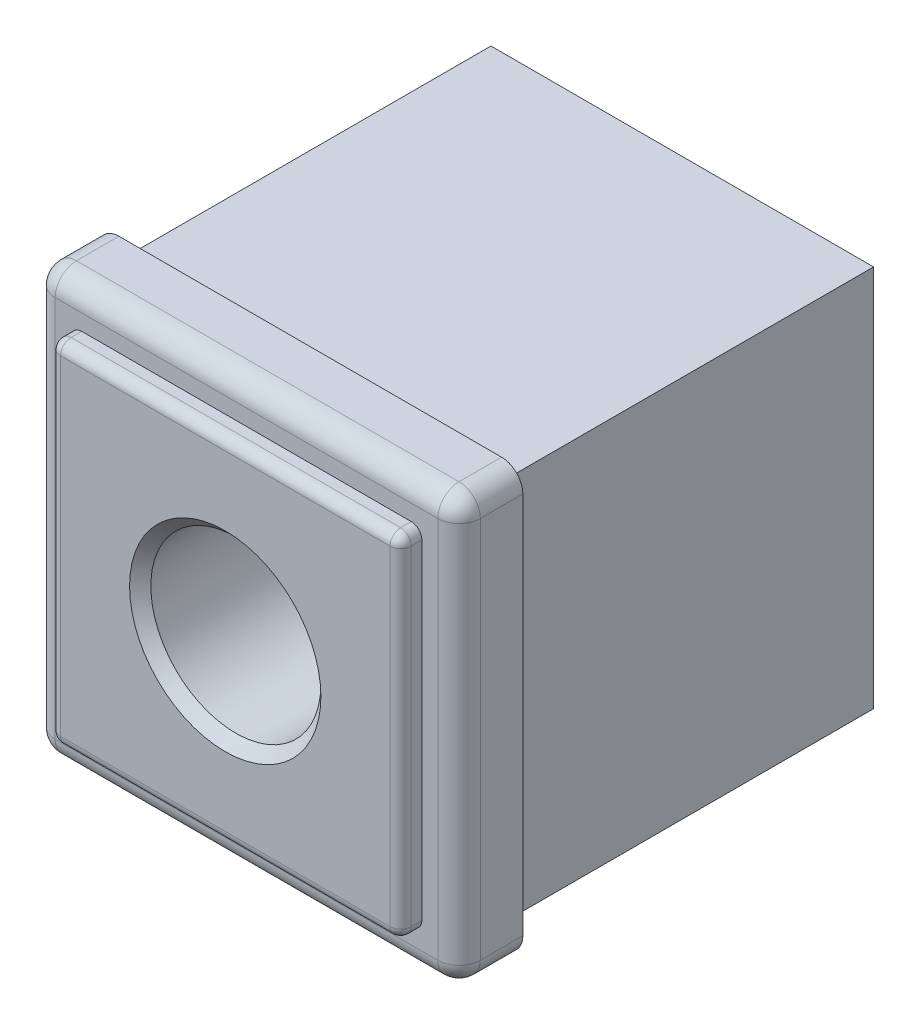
ISO-10303-21;
HEADER;
FILE_DESCRIPTION(('STEP AP214'),'2;1');
FILE_NAME('part.step','',(''),(''),'','','');
FILE_SCHEMA(('AUTOMOTIVE_DESIGN { 1 0 10303 214 1 1 1 1 }'));
ENDSEC;
DATA;
#1=APPLICATION_CONTEXT('core data for automotive mechanical design processes');
#2=APPLICATION_PROTOCOL_DEFINITION('international standard','automotive_design',2000,#1);
#3=PRODUCT_CONTEXT('',#1,'mechanical');
#4=PRODUCT('Part','Part','',(#3));
#5=PRODUCT_RELATED_PRODUCT_CATEGORY('part','',(#4));
#6=PRODUCT_DEFINITION_FORMATION('','',#4);
#7=PRODUCT_DEFINITION_CONTEXT('part definition',#1,'design');
#8=PRODUCT_DEFINITION('design','',#6,#7);
#9=PRODUCT_DEFINITION_SHAPE('','',#8);
#10=(LENGTH_UNIT() NAMED_UNIT(*) SI_UNIT(.MILLI.,.METRE.));
#11=(NAMED_UNIT(*) PLANE_ANGLE_UNIT() SI_UNIT($,.RADIAN.));
#12=(NAMED_UNIT(*) SI_UNIT($,.STERADIAN.) SOLID_ANGLE_UNIT());
#13=UNCERTAINTY_MEASURE_WITH_UNIT(LENGTH_MEASURE(1.E-05),#10,'distance_accuracy_value','');
#14=(GEOMETRIC_REPRESENTATION_CONTEXT(3) GLOBAL_UNCERTAINTY_ASSIGNED_CONTEXT((#13)) GLOBAL_UNIT_ASSIGNED_CONTEXT((#10,
#11,#12)) REPRESENTATION_CONTEXT('',''));
#15=CARTESIAN_POINT('',(0.,0.,0.));
#16=DIRECTION('',(0.,0.,1.));
#17=DIRECTION('',(1.,0.,0.));
#18=AXIS2_PLACEMENT_3D('',#15,#16,#17);
#19=CARTESIAN_POINT('',(20.,-20.,6.));
#20=DIRECTION('',(0.,0.,1.));
#21=DIRECTION('',(1.,0.,0.));
#22=AXIS2_PLACEMENT_3D('',#19,#20,#21);
#23=PLANE('',#22);
#24=DIRECTION('',(0.,1.,0.));
#25=VECTOR('',#24,1.);
#26=CARTESIAN_POINT('',(18.,18.,6.));
#27=LINE('',#26,#25);
#28=CARTESIAN_POINT('',(18.,-18.,6.));
#29=VERTEX_POINT('',#28);
#30=CARTESIAN_POINT('',(18.,18.,6.));
#31=VERTEX_POINT('',#30);
#32=EDGE_CURVE('E344',#29,#31,#27,.T.);
#33=ORIENTED_EDGE('',*,*,#32,.T.);
#34=DIRECTION('',(-1.,0.,0.));
#35=VECTOR('',#34,1.);
#36=CARTESIAN_POINT('',(-18.,18.,6.));
#37=LINE('',#36,#35);
#38=CARTESIAN_POINT('',(-18.,18.,6.));
#39=VERTEX_POINT('',#38);
#40=EDGE_CURVE('E348',#31,#39,#37,.T.);
#41=ORIENTED_EDGE('',*,*,#40,.T.);
#42=DIRECTION('',(0.,-1.,0.));
#43=VECTOR('',#42,1.);
#44=CARTESIAN_POINT('',(-18.,-18.,6.));
#45=LINE('',#44,#43);
#46=CARTESIAN_POINT('',(-18.,-18.,6.));
#47=VERTEX_POINT('',#46);
#48=EDGE_CURVE('E346',#39,#47,#45,.T.);
#49=ORIENTED_EDGE('',*,*,#48,.T.);
#50=DIRECTION('',(1.,0.,0.));
#51=VECTOR('',#50,1.);
#52=CARTESIAN_POINT('',(18.,-18.,6.));
#53=LINE('',#52,#51);
#54=EDGE_CURVE('E342',#47,#29,#53,.T.);
#55=ORIENTED_EDGE('',*,*,#54,.T.);
#56=EDGE_LOOP('',(#33,#41,#49,#55));
#57=FACE_BOUND('',#56,.T.);
#58=DIRECTION('',(1.,0.,0.));
#59=VECTOR('',#58,1.);
#60=CARTESIAN_POINT('',(-16.5,-16.5,6.));
#61=LINE('',#60,#59);
#62=CARTESIAN_POINT('',(-15.5,-16.5,6.));
#63=VERTEX_POINT('',#62);
#64=CARTESIAN_POINT('',(15.5,-16.5,6.));
#65=VERTEX_POINT('',#64);
#66=EDGE_CURVE('E266',#63,#65,#61,.T.);
#67=ORIENTED_EDGE('',*,*,#66,.F.);
#68=CARTESIAN_POINT('',(-15.5,-15.5,6.));
#69=DIRECTION('',(0.,0.,1.));
#70=DIRECTION('',(1.,0.,0.));
#71=AXIS2_PLACEMENT_3D('',#68,#69,#70);
#72=CIRCLE('',#71,1.);
#73=CARTESIAN_POINT('',(-16.5,-15.5,6.));
#74=VERTEX_POINT('',#73);
#75=EDGE_CURVE('E338',#63,#74,#72,.F.);
#76=ORIENTED_EDGE('',*,*,#75,.T.);
#77=DIRECTION('',(0.,-1.,0.));
#78=VECTOR('',#77,1.);
#79=CARTESIAN_POINT('',(-16.5,16.5,6.));
#80=LINE('',#79,#78);
#81=CARTESIAN_POINT('',(-16.5,15.5,6.));
#82=VERTEX_POINT('',#81);
#83=EDGE_CURVE('E263',#82,#74,#80,.T.);
#84=ORIENTED_EDGE('',*,*,#83,.F.);
#85=CARTESIAN_POINT('',(-15.5,15.5,6.));
#86=DIRECTION('',(0.,0.,1.));
#87=DIRECTION('',(1.,0.,0.));
#88=AXIS2_PLACEMENT_3D('',#85,#86,#87);
#89=CIRCLE('',#88,1.);
#90=CARTESIAN_POINT('',(-15.5,16.5,6.));
#91=VERTEX_POINT('',#90);
#92=EDGE_CURVE('E334',#82,#91,#89,.F.);
#93=ORIENTED_EDGE('',*,*,#92,.T.);
#94=DIRECTION('',(-1.,0.,0.));
#95=VECTOR('',#94,1.);
#96=CARTESIAN_POINT('',(-16.5,16.5,6.));
#97=LINE('',#96,#95);
#98=CARTESIAN_POINT('',(15.5,16.5,6.));
#99=VERTEX_POINT('',#98);
#100=EDGE_CURVE('E272',#99,#91,#97,.T.);
#101=ORIENTED_EDGE('',*,*,#100,.F.);
#102=CARTESIAN_POINT('',(15.5,15.5,6.));
#103=DIRECTION('',(0.,0.,1.));
#104=DIRECTION('',(1.,0.,0.));
#105=AXIS2_PLACEMENT_3D('',#102,#103,#104);
#106=CIRCLE('',#105,1.);
#107=CARTESIAN_POINT('',(16.5,15.5,6.));
#108=VERTEX_POINT('',#107);
#109=EDGE_CURVE('E336',#99,#108,#106,.F.);
#110=ORIENTED_EDGE('',*,*,#109,.T.);
#111=DIRECTION('',(0.,1.,0.));
#112=VECTOR('',#111,1.);
#113=CARTESIAN_POINT('',(16.5,16.5,6.));
#114=LINE('',#113,#112);
#115=CARTESIAN_POINT('',(16.5,-15.5,6.));
#116=VERTEX_POINT('',#115);
#117=EDGE_CURVE('E269',#116,#108,#114,.T.);
#118=ORIENTED_EDGE('',*,*,#117,.F.);
#119=CARTESIAN_POINT('',(15.5,-15.5,6.));
#120=DIRECTION('',(0.,0.,1.));
#121=DIRECTION('',(1.,0.,0.));
#122=AXIS2_PLACEMENT_3D('',#119,#120,#121);
#123=CIRCLE('',#122,1.);
#124=EDGE_CURVE('E340',#116,#65,#123,.F.);
#125=ORIENTED_EDGE('',*,*,#124,.T.);
#126=EDGE_LOOP('',(#67,#76,#84,#93,#101,#110,#118,#125));
#127=FACE_BOUND('',#126,.T.);
#128=ADVANCED_FACE('F14',(#57,#127),#23,.T.);
#129=CARTESIAN_POINT('',(-18.25,-18.25,-35.));
#130=DIRECTION('',(0.,0.,1.));
#131=DIRECTION('',(1.,0.,0.));
#132=AXIS2_PLACEMENT_3D('',#129,#130,#131);
#133=PLANE('',#132);
#134=DIRECTION('',(0.,1.,0.));
#135=VECTOR('',#134,1.);
#136=CARTESIAN_POINT('',(-18.,-18.,-35.));
#137=LINE('',#136,#135);
#138=CARTESIAN_POINT('',(-18.,-18.,-35.));
#139=VERTEX_POINT('',#138);
#140=CARTESIAN_POINT('',(-18.,18.,-35.));
#141=VERTEX_POINT('',#140);
#142=EDGE_CURVE('E198',#139,#141,#137,.T.);
#143=ORIENTED_EDGE('',*,*,#142,.T.);
#144=DIRECTION('',(1.,0.,0.));
#145=VECTOR('',#144,1.);
#146=CARTESIAN_POINT('',(-18.,18.,-35.));
#147=LINE('',#146,#145);
#148=CARTESIAN_POINT('',(18.,18.,-35.));
#149=VERTEX_POINT('',#148);
#150=EDGE_CURVE('E29',#141,#149,#147,.T.);
#151=ORIENTED_EDGE('',*,*,#150,.T.);
#152=DIRECTION('',(0.,-1.,0.));
#153=VECTOR('',#152,1.);
#154=CARTESIAN_POINT('',(18.,18.,-35.));
#155=LINE('',#154,#153);
#156=CARTESIAN_POINT('',(18.,-18.,-35.));
#157=VERTEX_POINT('',#156);
#158=EDGE_CURVE('E187',#149,#157,#155,.T.);
#159=ORIENTED_EDGE('',*,*,#158,.T.);
#160=DIRECTION('',(-1.,0.,0.));
#161=VECTOR('',#160,1.);
#162=CARTESIAN_POINT('',(18.,-18.,-35.));
#163=LINE('',#162,#161);
#164=EDGE_CURVE('E192',#157,#139,#163,.T.);
#165=ORIENTED_EDGE('',*,*,#164,.T.);
#166=EDGE_LOOP('',(#143,#151,#159,#165));
#167=FACE_BOUND('',#166,.T.);
#168=CARTESIAN_POINT('',(0.,0.,-35.));
#169=DIRECTION('',(0.,0.,1.));
#170=DIRECTION('',(1.,0.,0.));
#171=AXIS2_PLACEMENT_3D('',#168,#169,#170);
#172=CIRCLE('',#171,8.);
#173=CARTESIAN_POINT('',(8.,0.,-35.));
#174=VERTEX_POINT('',#173);
#175=EDGE_CURVE('E183',#174,#174,#172,.T.);
#176=ORIENTED_EDGE('',*,*,#175,.T.);
#177=EDGE_LOOP('',(#176));
#178=FACE_BOUND('',#177,.T.);
#179=ADVANCED_FACE('F195',(#167,#178),#133,.F.);
#180=CARTESIAN_POINT('',(20.,-20.,0.));
#181=DIRECTION('',(0.,0.,1.));
#182=DIRECTION('',(1.,0.,0.));
#183=AXIS2_PLACEMENT_3D('',#180,#181,#182);
#184=PLANE('',#183);
#185=DIRECTION('',(-1.,0.,0.));
#186=VECTOR('',#185,1.);
#187=CARTESIAN_POINT('',(-20.,20.,0.));
#188=LINE('',#187,#186);
#189=CARTESIAN_POINT('',(18.,20.,0.));
#190=VERTEX_POINT('',#189);
#191=CARTESIAN_POINT('',(-18.,20.,0.));
#192=VERTEX_POINT('',#191);
#193=EDGE_CURVE('E278',#190,#192,#188,.T.);
#194=ORIENTED_EDGE('',*,*,#193,.F.);
#195=CARTESIAN_POINT('',(18.,18.,0.));
#196=DIRECTION('',(0.,0.,1.));
#197=DIRECTION('',(1.,0.,0.));
#198=AXIS2_PLACEMENT_3D('',#195,#196,#197);
#199=CIRCLE('',#198,2.);
#200=CARTESIAN_POINT('',(20.,18.,0.));
#201=VERTEX_POINT('',#200);
#202=EDGE_CURVE('E298',#190,#201,#199,.F.);
#203=ORIENTED_EDGE('',*,*,#202,.T.);
#204=DIRECTION('',(0.,1.,0.));
#205=VECTOR('',#204,1.);
#206=CARTESIAN_POINT('',(20.,20.,0.));
#207=LINE('',#206,#205);
#208=CARTESIAN_POINT('',(20.,-18.,0.));
#209=VERTEX_POINT('',#208);
#210=EDGE_CURVE('E275',#209,#201,#207,.T.);
#211=ORIENTED_EDGE('',*,*,#210,.F.);
#212=CARTESIAN_POINT('',(18.,-18.,0.));
#213=DIRECTION('',(0.,0.,1.));
#214=DIRECTION('',(1.,0.,0.));
#215=AXIS2_PLACEMENT_3D('',#212,#213,#214);
#216=CIRCLE('',#215,2.);
#217=CARTESIAN_POINT('',(18.,-20.,0.));
#218=VERTEX_POINT('',#217);
#219=EDGE_CURVE('E294',#209,#218,#216,.F.);
#220=ORIENTED_EDGE('',*,*,#219,.T.);
#221=DIRECTION('',(1.,0.,0.));
#222=VECTOR('',#221,1.);
#223=CARTESIAN_POINT('',(-20.,-20.,0.));
#224=LINE('',#223,#222);
#225=CARTESIAN_POINT('',(-18.,-20.,0.));
#226=VERTEX_POINT('',#225);
#227=EDGE_CURVE('E284',#226,#218,#224,.T.);
#228=ORIENTED_EDGE('',*,*,#227,.F.);
#229=CARTESIAN_POINT('',(-18.,-18.,0.));
#230=DIRECTION('',(0.,0.,1.));
#231=DIRECTION('',(1.,0.,0.));
#232=AXIS2_PLACEMENT_3D('',#229,#230,#231);
#233=CIRCLE('',#232,2.);
#234=CARTESIAN_POINT('',(-20.,-18.,0.));
#235=VERTEX_POINT('',#234);
#236=EDGE_CURVE('E292',#226,#235,#233,.F.);
#237=ORIENTED_EDGE('',*,*,#236,.T.);
#238=DIRECTION('',(0.,-1.,0.));
#239=VECTOR('',#238,1.);
#240=CARTESIAN_POINT('',(-20.,20.,0.));
#241=LINE('',#240,#239);
#242=CARTESIAN_POINT('',(-20.,18.,0.));
#243=VERTEX_POINT('',#242);
#244=EDGE_CURVE('E281',#243,#235,#241,.T.);
#245=ORIENTED_EDGE('',*,*,#244,.F.);
#246=CARTESIAN_POINT('',(-18.,18.,0.));
#247=DIRECTION('',(0.,0.,1.));
#248=DIRECTION('',(1.,0.,0.));
#249=AXIS2_PLACEMENT_3D('',#246,#247,#248);
#250=CIRCLE('',#249,2.);
#251=EDGE_CURVE('E296',#243,#192,#250,.F.);
#252=ORIENTED_EDGE('',*,*,#251,.T.);
#253=EDGE_LOOP('',(#194,#203,#211,#220,#228,#237,#245,#252));
#254=FACE_BOUND('',#253,.T.);
#255=DIRECTION('',(1.,0.,0.));
#256=VECTOR('',#255,1.);
#257=CARTESIAN_POINT('',(-18.,18.,0.));
#258=LINE('',#257,#256);
#259=CARTESIAN_POINT('',(-18.,18.,0.));
#260=VERTEX_POINT('',#259);
#261=CARTESIAN_POINT('',(18.,18.,0.));
#262=VERTEX_POINT('',#261);
#263=EDGE_CURVE('E180',#260,#262,#258,.T.);
#264=ORIENTED_EDGE('',*,*,#263,.F.);
#265=DIRECTION('',(0.,1.,0.));
#266=VECTOR('',#265,1.);
#267=CARTESIAN_POINT('',(-18.,-18.,0.));
#268=LINE('',#267,#266);
#269=CARTESIAN_POINT('',(-18.,-18.,0.));
#270=VERTEX_POINT('',#269);
#271=EDGE_CURVE('E199',#270,#260,#268,.T.);
#272=ORIENTED_EDGE('',*,*,#271,.F.);
#273=DIRECTION('',(-1.,0.,0.));
#274=VECTOR('',#273,1.);
#275=CARTESIAN_POINT('',(18.,-18.,0.));
#276=LINE('',#275,#274);
#277=CARTESIAN_POINT('',(18.,-18.,0.));
#278=VERTEX_POINT('',#277);
#279=EDGE_CURVE('E202',#278,#270,#276,.T.);
#280=ORIENTED_EDGE('',*,*,#279,.F.);
#281=DIRECTION('',(0.,-1.,0.));
#282=VECTOR('',#281,1.);
#283=CARTESIAN_POINT('',(18.,18.,0.));
#284=LINE('',#283,#282);
#285=EDGE_CURVE('E209',#262,#278,#284,.T.);
#286=ORIENTED_EDGE('',*,*,#285,.F.);
#287=EDGE_LOOP('',(#264,#272,#280,#286));
#288=FACE_BOUND('',#287,.T.);
#289=ADVANCED_FACE('F417',(#254,#288),#184,.F.);
#290=CARTESIAN_POINT('',(20.,20.,6.));
#291=DIRECTION('',(-1.,0.,0.));
#292=DIRECTION('',(0.,-1.,0.));
#293=AXIS2_PLACEMENT_3D('',#290,#291,#292);
#294=PLANE('',#293);
#295=DIRECTION('',(0.,0.,-1.));
#296=VECTOR('',#295,1.);
#297=CARTESIAN_POINT('',(20.,18.,6.));
#298=LINE('',#297,#296);
#299=CARTESIAN_POINT('',(20.,18.,4.));
#300=VERTEX_POINT('',#299);
#301=EDGE_CURVE('E302',#201,#300,#298,.F.);
#302=ORIENTED_EDGE('',*,*,#301,.T.);
#303=DIRECTION('',(0.,1.,0.));
#304=VECTOR('',#303,1.);
#305=CARTESIAN_POINT('',(20.,-18.,4.));
#306=LINE('',#305,#304);
#307=CARTESIAN_POINT('',(20.,-18.,4.));
#308=VERTEX_POINT('',#307);
#309=EDGE_CURVE('E360',#300,#308,#306,.F.);
#310=ORIENTED_EDGE('',*,*,#309,.T.);
#311=DIRECTION('',(0.,0.,-1.));
#312=VECTOR('',#311,1.);
#313=CARTESIAN_POINT('',(20.,-18.,6.));
#314=LINE('',#313,#312);
#315=EDGE_CURVE('E300',#308,#209,#314,.T.);
#316=ORIENTED_EDGE('',*,*,#315,.T.);
#317=ORIENTED_EDGE('',*,*,#210,.T.);
#318=EDGE_LOOP('',(#302,#310,#316,#317));
#319=FACE_BOUND('',#318,.T.);
#320=ADVANCED_FACE('F434',(#319),#294,.F.);
#321=CARTESIAN_POINT('',(-20.,20.,6.));
#322=DIRECTION('',(0.,-1.,0.));
#323=DIRECTION('',(0.,0.,-1.));
#324=AXIS2_PLACEMENT_3D('',#321,#322,#323);
#325=PLANE('',#324);
#326=DIRECTION('',(0.,0.,-1.));
#327=VECTOR('',#326,1.);
#328=CARTESIAN_POINT('',(-18.,20.,6.));
#329=LINE('',#328,#327);
#330=CARTESIAN_POINT('',(-18.,20.,4.));
#331=VERTEX_POINT('',#330);
#332=EDGE_CURVE('E287',#192,#331,#329,.F.);
#333=ORIENTED_EDGE('',*,*,#332,.T.);
#334=DIRECTION('',(-1.,0.,0.));
#335=VECTOR('',#334,1.);
#336=CARTESIAN_POINT('',(18.,20.,4.));
#337=LINE('',#336,#335);
#338=CARTESIAN_POINT('',(18.,20.,4.));
#339=VERTEX_POINT('',#338);
#340=EDGE_CURVE('E351',#331,#339,#337,.F.);
#341=ORIENTED_EDGE('',*,*,#340,.T.);
#342=DIRECTION('',(0.,0.,-1.));
#343=VECTOR('',#342,1.);
#344=CARTESIAN_POINT('',(18.,20.,6.));
#345=LINE('',#344,#343);
#346=EDGE_CURVE('E290',#339,#190,#345,.T.);
#347=ORIENTED_EDGE('',*,*,#346,.T.);
#348=ORIENTED_EDGE('',*,*,#193,.T.);
#349=EDGE_LOOP('',(#333,#341,#347,#348));
#350=FACE_BOUND('',#349,.T.);
#351=ADVANCED_FACE('F430',(#350),#325,.F.);
#352=CARTESIAN_POINT('',(-20.,20.,6.));
#353=DIRECTION('',(1.,0.,0.));
#354=DIRECTION('',(0.,0.,-1.));
#355=AXIS2_PLACEMENT_3D('',#352,#353,#354);
#356=PLANE('',#355);
#357=DIRECTION('',(0.,0.,-1.));
#358=VECTOR('',#357,1.);
#359=CARTESIAN_POINT('',(-20.,-18.,6.));
#360=LINE('',#359,#358);
#361=CARTESIAN_POINT('',(-20.,-18.,4.));
#362=VERTEX_POINT('',#361);
#363=EDGE_CURVE('E305',#235,#362,#360,.F.);
#364=ORIENTED_EDGE('',*,*,#363,.T.);
#365=DIRECTION('',(0.,-1.,0.));
#366=VECTOR('',#365,1.);
#367=CARTESIAN_POINT('',(-20.,18.,4.));
#368=LINE('',#367,#366);
#369=CARTESIAN_POINT('',(-20.,18.,4.));
#370=VERTEX_POINT('',#369);
#371=EDGE_CURVE('E358',#362,#370,#368,.F.);
#372=ORIENTED_EDGE('',*,*,#371,.T.);
#373=DIRECTION('',(0.,0.,-1.));
#374=VECTOR('',#373,1.);
#375=CARTESIAN_POINT('',(-20.,18.,6.));
#376=LINE('',#375,#374);
#377=EDGE_CURVE('E308',#370,#243,#376,.T.);
#378=ORIENTED_EDGE('',*,*,#377,.T.);
#379=ORIENTED_EDGE('',*,*,#244,.T.);
#380=EDGE_LOOP('',(#364,#372,#378,#379));
#381=FACE_BOUND('',#380,.T.);
#382=ADVANCED_FACE('F426',(#381),#356,.F.);
#383=CARTESIAN_POINT('',(-20.,-20.,6.));
#384=DIRECTION('',(0.,1.,0.));
#385=DIRECTION('',(0.,0.,1.));
#386=AXIS2_PLACEMENT_3D('',#383,#384,#385);
#387=PLANE('',#386);
#388=DIRECTION('',(0.,0.,-1.));
#389=VECTOR('',#388,1.);
#390=CARTESIAN_POINT('',(18.,-20.,6.));
#391=LINE('',#390,#389);
#392=CARTESIAN_POINT('',(18.,-20.,4.));
#393=VERTEX_POINT('',#392);
#394=EDGE_CURVE('E312',#218,#393,#391,.F.);
#395=ORIENTED_EDGE('',*,*,#394,.T.);
#396=DIRECTION('',(1.,0.,0.));
#397=VECTOR('',#396,1.);
#398=CARTESIAN_POINT('',(-18.,-20.,4.));
#399=LINE('',#398,#397);
#400=CARTESIAN_POINT('',(-18.,-20.,4.));
#401=VERTEX_POINT('',#400);
#402=EDGE_CURVE('E366',#393,#401,#399,.F.);
#403=ORIENTED_EDGE('',*,*,#402,.T.);
#404=DIRECTION('',(0.,0.,-1.));
#405=VECTOR('',#404,1.);
#406=CARTESIAN_POINT('',(-18.,-20.,6.));
#407=LINE('',#406,#405);
#408=EDGE_CURVE('E310',#401,#226,#407,.T.);
#409=ORIENTED_EDGE('',*,*,#408,.T.);
#410=ORIENTED_EDGE('',*,*,#227,.T.);
#411=EDGE_LOOP('',(#395,#403,#409,#410));
#412=FACE_BOUND('',#411,.T.);
#413=ADVANCED_FACE('F422',(#412),#387,.F.);
#414=CARTESIAN_POINT('',(-16.5,16.5,8.));
#415=DIRECTION('',(1.,0.,0.));
#416=DIRECTION('',(0.,1.,0.));
#417=AXIS2_PLACEMENT_3D('',#414,#415,#416);
#418=PLANE('',#417);
#419=DIRECTION('',(0.,0.,-1.));
#420=VECTOR('',#419,1.);
#421=CARTESIAN_POINT('',(-16.5,-15.5,8.));
#422=LINE('',#421,#420);
#423=CARTESIAN_POINT('',(-16.5,-15.5,7.));
#424=VERTEX_POINT('',#423);
#425=EDGE_CURVE('E315',#74,#424,#422,.F.);
#426=ORIENTED_EDGE('',*,*,#425,.T.);
#427=DIRECTION('',(0.,-1.,0.));
#428=VECTOR('',#427,1.);
#429=CARTESIAN_POINT('',(-16.5,15.5,7.));
#430=LINE('',#429,#428);
#431=CARTESIAN_POINT('',(-16.5,15.5,7.));
#432=VERTEX_POINT('',#431);
#433=EDGE_CURVE('E377',#424,#432,#430,.F.);
#434=ORIENTED_EDGE('',*,*,#433,.T.);
#435=DIRECTION('',(0.,0.,-1.));
#436=VECTOR('',#435,1.);
#437=CARTESIAN_POINT('',(-16.5,15.5,8.));
#438=LINE('',#437,#436);
#439=EDGE_CURVE('E318',#432,#82,#438,.T.);
#440=ORIENTED_EDGE('',*,*,#439,.T.);
#441=ORIENTED_EDGE('',*,*,#83,.T.);
#442=EDGE_LOOP('',(#426,#434,#440,#441));
#443=FACE_BOUND('',#442,.T.);
#444=ADVANCED_FACE('F425',(#443),#418,.F.);
#445=CARTESIAN_POINT('',(-16.5,-16.5,8.));
#446=DIRECTION('',(0.,1.,0.));
#447=DIRECTION('',(-1.,0.,0.));
#448=AXIS2_PLACEMENT_3D('',#445,#446,#447);
#449=PLANE('',#448);
#450=DIRECTION('',(0.,0.,-1.));
#451=VECTOR('',#450,1.);
#452=CARTESIAN_POINT('',(15.5,-16.5,8.));
#453=LINE('',#452,#451);
#454=CARTESIAN_POINT('',(15.5,-16.5,7.));
#455=VERTEX_POINT('',#454);
#456=EDGE_CURVE('E329',#65,#455,#453,.F.);
#457=ORIENTED_EDGE('',*,*,#456,.T.);
#458=DIRECTION('',(1.,0.,0.));
#459=VECTOR('',#458,1.);
#460=CARTESIAN_POINT('',(-15.5,-16.5,7.));
#461=LINE('',#460,#459);
#462=CARTESIAN_POINT('',(-15.5,-16.5,7.));
#463=VERTEX_POINT('',#462);
#464=EDGE_CURVE('E384',#455,#463,#461,.F.);
#465=ORIENTED_EDGE('',*,*,#464,.T.);
#466=DIRECTION('',(0.,0.,-1.));
#467=VECTOR('',#466,1.);
#468=CARTESIAN_POINT('',(-15.5,-16.5,8.));
#469=LINE('',#468,#467);
#470=EDGE_CURVE('E332',#463,#63,#469,.T.);
#471=ORIENTED_EDGE('',*,*,#470,.T.);
#472=ORIENTED_EDGE('',*,*,#66,.T.);
#473=EDGE_LOOP('',(#457,#465,#471,#472));
#474=FACE_BOUND('',#473,.T.);
#475=ADVANCED_FACE('F526',(#474),#449,.F.);
#476=CARTESIAN_POINT('',(16.5,16.5,8.));
#477=DIRECTION('',(-1.,0.,0.));
#478=DIRECTION('',(0.,0.,1.));
#479=AXIS2_PLACEMENT_3D('',#476,#477,#478);
#480=PLANE('',#479);
#481=DIRECTION('',(0.,0.,-1.));
#482=VECTOR('',#481,1.);
#483=CARTESIAN_POINT('',(16.5,15.5,8.));
#484=LINE('',#483,#482);
#485=CARTESIAN_POINT('',(16.5,15.5,7.));
#486=VERTEX_POINT('',#485);
#487=EDGE_CURVE('E327',#108,#486,#484,.F.);
#488=ORIENTED_EDGE('',*,*,#487,.T.);
#489=DIRECTION('',(0.,1.,0.));
#490=VECTOR('',#489,1.);
#491=CARTESIAN_POINT('',(16.5,-15.5,7.));
#492=LINE('',#491,#490);
#493=CARTESIAN_POINT('',(16.5,-15.5,7.));
#494=VERTEX_POINT('',#493);
#495=EDGE_CURVE('E391',#486,#494,#492,.F.);
#496=ORIENTED_EDGE('',*,*,#495,.T.);
#497=DIRECTION('',(0.,0.,-1.));
#498=VECTOR('',#497,1.);
#499=CARTESIAN_POINT('',(16.5,-15.5,8.));
#500=LINE('',#499,#498);
#501=EDGE_CURVE('E325',#494,#116,#500,.T.);
#502=ORIENTED_EDGE('',*,*,#501,.T.);
#503=ORIENTED_EDGE('',*,*,#117,.T.);
#504=EDGE_LOOP('',(#488,#496,#502,#503));
#505=FACE_BOUND('',#504,.T.);
#506=ADVANCED_FACE('F522',(#505),#480,.F.);
#507=CARTESIAN_POINT('',(-16.5,16.5,8.));
#508=DIRECTION('',(0.,-1.,0.));
#509=DIRECTION('',(1.,0.,0.));
#510=AXIS2_PLACEMENT_3D('',#507,#508,#509);
#511=PLANE('',#510);
#512=DIRECTION('',(0.,0.,-1.));
#513=VECTOR('',#512,1.);
#514=CARTESIAN_POINT('',(-15.5,16.5,8.));
#515=LINE('',#514,#513);
#516=CARTESIAN_POINT('',(-15.5,16.5,7.));
#517=VERTEX_POINT('',#516);
#518=EDGE_CURVE('E322',#91,#517,#515,.F.);
#519=ORIENTED_EDGE('',*,*,#518,.T.);
#520=DIRECTION('',(-1.,0.,0.));
#521=VECTOR('',#520,1.);
#522=CARTESIAN_POINT('',(15.5,16.5,7.));
#523=LINE('',#522,#521);
#524=CARTESIAN_POINT('',(15.5,16.5,7.));
#525=VERTEX_POINT('',#524);
#526=EDGE_CURVE('E386',#517,#525,#523,.F.);
#527=ORIENTED_EDGE('',*,*,#526,.T.);
#528=DIRECTION('',(0.,0.,-1.));
#529=VECTOR('',#528,1.);
#530=CARTESIAN_POINT('',(15.5,16.5,8.));
#531=LINE('',#530,#529);
#532=EDGE_CURVE('E320',#525,#99,#531,.T.);
#533=ORIENTED_EDGE('',*,*,#532,.T.);
#534=ORIENTED_EDGE('',*,*,#100,.T.);
#535=EDGE_LOOP('',(#519,#527,#533,#534));
#536=FACE_BOUND('',#535,.T.);
#537=ADVANCED_FACE('F518',(#536),#511,.F.);
#538=CARTESIAN_POINT('',(-16.5,-16.5,8.));
#539=DIRECTION('',(0.,0.,1.));
#540=DIRECTION('',(1.,0.,0.));
#541=AXIS2_PLACEMENT_3D('',#538,#539,#540);
#542=PLANE('',#541);
#543=CARTESIAN_POINT('',(0.,0.,8.));
#544=DIRECTION('',(0.,0.,1.));
#545=DIRECTION('',(1.,0.,0.));
#546=AXIS2_PLACEMENT_3D('',#543,#544,#545);
#547=CIRCLE('',#546,9.);
#548=CARTESIAN_POINT('',(9.,0.,8.));
#549=VERTEX_POINT('',#548);
#550=EDGE_CURVE('E9',#549,#549,#547,.F.);
#551=ORIENTED_EDGE('',*,*,#550,.T.);
#552=EDGE_LOOP('',(#551));
#553=FACE_BOUND('',#552,.T.);
#554=DIRECTION('',(-1.,0.,0.));
#555=VECTOR('',#554,1.);
#556=CARTESIAN_POINT('',(-15.5,15.5,8.));
#557=LINE('',#556,#555);
#558=CARTESIAN_POINT('',(15.5,15.5,8.));
#559=VERTEX_POINT('',#558);
#560=CARTESIAN_POINT('',(-15.5,15.5,8.));
#561=VERTEX_POINT('',#560);
#562=EDGE_CURVE('E370',#559,#561,#557,.T.);
#563=ORIENTED_EDGE('',*,*,#562,.T.);
#564=DIRECTION('',(0.,-1.,0.));
#565=VECTOR('',#564,1.);
#566=CARTESIAN_POINT('',(-15.5,-15.5,8.));
#567=LINE('',#566,#565);
#568=CARTESIAN_POINT('',(-15.5,-15.5,8.));
#569=VERTEX_POINT('',#568);
#570=EDGE_CURVE('E374',#561,#569,#567,.T.);
#571=ORIENTED_EDGE('',*,*,#570,.T.);
#572=DIRECTION('',(1.,0.,0.));
#573=VECTOR('',#572,1.);
#574=CARTESIAN_POINT('',(15.5,-15.5,8.));
#575=LINE('',#574,#573);
#576=CARTESIAN_POINT('',(15.5,-15.5,8.));
#577=VERTEX_POINT('',#576);
#578=EDGE_CURVE('E372',#569,#577,#575,.T.);
#579=ORIENTED_EDGE('',*,*,#578,.T.);
#580=DIRECTION('',(0.,1.,0.));
#581=VECTOR('',#580,1.);
#582=CARTESIAN_POINT('',(15.5,15.5,8.));
#583=LINE('',#582,#581);
#584=EDGE_CURVE('E368',#577,#559,#583,.T.);
#585=ORIENTED_EDGE('',*,*,#584,.T.);
#586=EDGE_LOOP('',(#563,#571,#579,#585));
#587=FACE_BOUND('',#586,.T.);
#588=ADVANCED_FACE('F512',(#553,#587),#542,.T.);
#589=CARTESIAN_POINT('',(18.,18.,6.));
#590=DIRECTION('',(0.,0.,-1.));
#591=DIRECTION('',(-1.,0.,0.));
#592=AXIS2_PLACEMENT_3D('',#589,#590,#591);
#593=CYLINDRICAL_SURFACE('',#592,2.);
#594=ORIENTED_EDGE('',*,*,#346,.F.);
#595=CARTESIAN_POINT('',(18.,18.,4.));
#596=DIRECTION('',(0.,0.,-1.));
#597=DIRECTION('',(-1.,0.,0.));
#598=AXIS2_PLACEMENT_3D('',#595,#596,#597);
#599=CIRCLE('',#598,2.);
#600=EDGE_CURVE('E356',#339,#300,#599,.T.);
#601=ORIENTED_EDGE('',*,*,#600,.T.);
#602=ORIENTED_EDGE('',*,*,#301,.F.);
#603=ORIENTED_EDGE('',*,*,#202,.F.);
#604=EDGE_LOOP('',(#594,#601,#602,#603));
#605=FACE_BOUND('',#604,.T.);
#606=ADVANCED_FACE('F484',(#605),#593,.T.);
#607=CARTESIAN_POINT('',(-18.,18.,6.));
#608=DIRECTION('',(0.,0.,-1.));
#609=DIRECTION('',(-1.,0.,0.));
#610=AXIS2_PLACEMENT_3D('',#607,#608,#609);
#611=CYLINDRICAL_SURFACE('',#610,2.);
#612=ORIENTED_EDGE('',*,*,#377,.F.);
#613=CARTESIAN_POINT('',(-18.,18.,4.));
#614=DIRECTION('',(0.,0.,-1.));
#615=DIRECTION('',(-1.,0.,0.));
#616=AXIS2_PLACEMENT_3D('',#613,#614,#615);
#617=CIRCLE('',#616,2.);
#618=EDGE_CURVE('E354',#370,#331,#617,.T.);
#619=ORIENTED_EDGE('',*,*,#618,.T.);
#620=ORIENTED_EDGE('',*,*,#332,.F.);
#621=ORIENTED_EDGE('',*,*,#251,.F.);
#622=EDGE_LOOP('',(#612,#619,#620,#621));
#623=FACE_BOUND('',#622,.T.);
#624=ADVANCED_FACE('F503',(#623),#611,.T.);
#625=CARTESIAN_POINT('',(18.,-18.,6.));
#626=DIRECTION('',(0.,0.,-1.));
#627=DIRECTION('',(-1.,0.,0.));
#628=AXIS2_PLACEMENT_3D('',#625,#626,#627);
#629=CYLINDRICAL_SURFACE('',#628,2.);
#630=ORIENTED_EDGE('',*,*,#315,.F.);
#631=CARTESIAN_POINT('',(18.,-18.,4.));
#632=DIRECTION('',(0.,0.,-1.));
#633=DIRECTION('',(-1.,0.,0.));
#634=AXIS2_PLACEMENT_3D('',#631,#632,#633);
#635=CIRCLE('',#634,2.);
#636=EDGE_CURVE('E364',#308,#393,#635,.T.);
#637=ORIENTED_EDGE('',*,*,#636,.T.);
#638=ORIENTED_EDGE('',*,*,#394,.F.);
#639=ORIENTED_EDGE('',*,*,#219,.F.);
#640=EDGE_LOOP('',(#630,#637,#638,#639));
#641=FACE_BOUND('',#640,.T.);
#642=ADVANCED_FACE('F475',(#641),#629,.T.);
#643=CARTESIAN_POINT('',(-18.,-18.,6.));
#644=DIRECTION('',(0.,0.,-1.));
#645=DIRECTION('',(-1.,0.,0.));
#646=AXIS2_PLACEMENT_3D('',#643,#644,#645);
#647=CYLINDRICAL_SURFACE('',#646,2.);
#648=ORIENTED_EDGE('',*,*,#408,.F.);
#649=CARTESIAN_POINT('',(-18.,-18.,4.));
#650=DIRECTION('',(0.,0.,-1.));
#651=DIRECTION('',(-1.,0.,0.));
#652=AXIS2_PLACEMENT_3D('',#649,#650,#651);
#653=CIRCLE('',#652,2.);
#654=EDGE_CURVE('E362',#401,#362,#653,.T.);
#655=ORIENTED_EDGE('',*,*,#654,.T.);
#656=ORIENTED_EDGE('',*,*,#363,.F.);
#657=ORIENTED_EDGE('',*,*,#236,.F.);
#658=EDGE_LOOP('',(#648,#655,#656,#657));
#659=FACE_BOUND('',#658,.T.);
#660=ADVANCED_FACE('F499',(#659),#647,.T.);
#661=CARTESIAN_POINT('',(-15.5,15.5,8.));
#662=DIRECTION('',(0.,0.,-1.));
#663=DIRECTION('',(-1.,0.,0.));
#664=AXIS2_PLACEMENT_3D('',#661,#662,#663);
#665=CYLINDRICAL_SURFACE('',#664,1.);
#666=ORIENTED_EDGE('',*,*,#439,.F.);
#667=CARTESIAN_POINT('',(-15.5,15.5,7.));
#668=DIRECTION('',(0.,0.,-1.));
#669=DIRECTION('',(-1.,0.,0.));
#670=AXIS2_PLACEMENT_3D('',#667,#668,#669);
#671=CIRCLE('',#670,1.);
#672=EDGE_CURVE('E382',#432,#517,#671,.T.);
#673=ORIENTED_EDGE('',*,*,#672,.T.);
#674=ORIENTED_EDGE('',*,*,#518,.F.);
#675=ORIENTED_EDGE('',*,*,#92,.F.);
#676=EDGE_LOOP('',(#666,#673,#674,#675));
#677=FACE_BOUND('',#676,.T.);
#678=ADVANCED_FACE('F567',(#677),#665,.T.);
#679=CARTESIAN_POINT('',(15.5,15.5,8.));
#680=DIRECTION('',(0.,0.,-1.));
#681=DIRECTION('',(-1.,0.,0.));
#682=AXIS2_PLACEMENT_3D('',#679,#680,#681);
#683=CYLINDRICAL_SURFACE('',#682,1.);
#684=ORIENTED_EDGE('',*,*,#532,.F.);
#685=CARTESIAN_POINT('',(15.5,15.5,7.));
#686=DIRECTION('',(0.,0.,-1.));
#687=DIRECTION('',(-1.,0.,0.));
#688=AXIS2_PLACEMENT_3D('',#685,#686,#687);
#689=CIRCLE('',#688,1.);
#690=EDGE_CURVE('E37',#525,#486,#689,.T.);
#691=ORIENTED_EDGE('',*,*,#690,.T.);
#692=ORIENTED_EDGE('',*,*,#487,.F.);
#693=ORIENTED_EDGE('',*,*,#109,.F.);
#694=EDGE_LOOP('',(#684,#691,#692,#693));
#695=FACE_BOUND('',#694,.T.);
#696=ADVANCED_FACE('F620',(#695),#683,.T.);
#697=CARTESIAN_POINT('',(-15.5,-15.5,8.));
#698=DIRECTION('',(0.,0.,-1.));
#699=DIRECTION('',(-1.,0.,0.));
#700=AXIS2_PLACEMENT_3D('',#697,#698,#699);
#701=CYLINDRICAL_SURFACE('',#700,1.);
#702=ORIENTED_EDGE('',*,*,#470,.F.);
#703=CARTESIAN_POINT('',(-15.5,-15.5,7.));
#704=DIRECTION('',(0.,0.,-1.));
#705=DIRECTION('',(-1.,0.,0.));
#706=AXIS2_PLACEMENT_3D('',#703,#704,#705);
#707=CIRCLE('',#706,1.);
#708=EDGE_CURVE('E380',#463,#424,#707,.T.);
#709=ORIENTED_EDGE('',*,*,#708,.T.);
#710=ORIENTED_EDGE('',*,*,#425,.F.);
#711=ORIENTED_EDGE('',*,*,#75,.F.);
#712=EDGE_LOOP('',(#702,#709,#710,#711));
#713=FACE_BOUND('',#712,.T.);
#714=ADVANCED_FACE('F574',(#713),#701,.T.);
#715=CARTESIAN_POINT('',(15.5,-15.5,8.));
#716=DIRECTION('',(0.,0.,-1.));
#717=DIRECTION('',(-1.,0.,0.));
#718=AXIS2_PLACEMENT_3D('',#715,#716,#717);
#719=CYLINDRICAL_SURFACE('',#718,1.);
#720=ORIENTED_EDGE('',*,*,#501,.F.);
#721=CARTESIAN_POINT('',(15.5,-15.5,7.));
#722=DIRECTION('',(0.,0.,-1.));
#723=DIRECTION('',(-1.,0.,0.));
#724=AXIS2_PLACEMENT_3D('',#721,#722,#723);
#725=CIRCLE('',#724,1.);
#726=EDGE_CURVE('E388',#494,#455,#725,.T.);
#727=ORIENTED_EDGE('',*,*,#726,.T.);
#728=ORIENTED_EDGE('',*,*,#456,.F.);
#729=ORIENTED_EDGE('',*,*,#124,.F.);
#730=EDGE_LOOP('',(#720,#727,#728,#729));
#731=FACE_BOUND('',#730,.T.);
#732=ADVANCED_FACE('F615',(#731),#719,.T.);
#733=CARTESIAN_POINT('',(20.,-18.,4.));
#734=DIRECTION('',(-1.,0.,0.));
#735=DIRECTION('',(0.,0.,1.));
#736=AXIS2_PLACEMENT_3D('',#733,#734,#735);
#737=CYLINDRICAL_SURFACE('',#736,2.);
#738=CARTESIAN_POINT('',(-18.,-18.,4.));
#739=DIRECTION('',(-1.,0.,0.));
#740=DIRECTION('',(0.,0.,1.));
#741=AXIS2_PLACEMENT_3D('',#738,#739,#740);
#742=CIRCLE('',#741,2.);
#743=EDGE_CURVE('E257',#401,#47,#742,.T.);
#744=ORIENTED_EDGE('',*,*,#743,.F.);
#745=ORIENTED_EDGE('',*,*,#402,.F.);
#746=CARTESIAN_POINT('',(18.,-18.,4.));
#747=DIRECTION('',(1.,0.,0.));
#748=DIRECTION('',(0.,0.,-1.));
#749=AXIS2_PLACEMENT_3D('',#746,#747,#748);
#750=CIRCLE('',#749,2.);
#751=EDGE_CURVE('E260',#29,#393,#750,.T.);
#752=ORIENTED_EDGE('',*,*,#751,.F.);
#753=ORIENTED_EDGE('',*,*,#54,.F.);
#754=EDGE_LOOP('',(#744,#745,#752,#753));
#755=FACE_BOUND('',#754,.T.);
#756=ADVANCED_FACE('F469',(#755),#737,.T.);
#757=CARTESIAN_POINT('',(18.,-18.,4.));
#758=DIRECTION('',(0.,0.,1.));
#759=DIRECTION('',(1.,0.,0.));
#760=AXIS2_PLACEMENT_3D('',#757,#758,#759);
#761=SPHERICAL_SURFACE('',#760,2.);
#762=ORIENTED_EDGE('',*,*,#751,.T.);
#763=ORIENTED_EDGE('',*,*,#636,.F.);
#764=CARTESIAN_POINT('',(18.,-18.,4.));
#765=DIRECTION('',(0.,1.,0.));
#766=DIRECTION('',(0.,0.,1.));
#767=AXIS2_PLACEMENT_3D('',#764,#765,#766);
#768=CIRCLE('',#767,2.);
#769=EDGE_CURVE('E254',#29,#308,#768,.T.);
#770=ORIENTED_EDGE('',*,*,#769,.F.);
#771=EDGE_LOOP('',(#762,#763,#770));
#772=FACE_BOUND('',#771,.T.);
#773=ADVANCED_FACE('F472',(#772),#761,.T.);
#774=CARTESIAN_POINT('',(-18.,-18.,4.));
#775=DIRECTION('',(0.,0.,1.));
#776=DIRECTION('',(1.,0.,0.));
#777=AXIS2_PLACEMENT_3D('',#774,#775,#776);
#778=SPHERICAL_SURFACE('',#777,2.);
#779=ORIENTED_EDGE('',*,*,#654,.F.);
#780=ORIENTED_EDGE('',*,*,#743,.T.);
#781=CARTESIAN_POINT('',(-18.,-18.,4.));
#782=DIRECTION('',(0.,1.,0.));
#783=DIRECTION('',(-1.,0.,0.));
#784=AXIS2_PLACEMENT_3D('',#781,#782,#783);
#785=CIRCLE('',#784,2.);
#786=EDGE_CURVE('E251',#362,#47,#785,.T.);
#787=ORIENTED_EDGE('',*,*,#786,.F.);
#788=EDGE_LOOP('',(#779,#780,#787));
#789=FACE_BOUND('',#788,.T.);
#790=ADVANCED_FACE('F496',(#789),#778,.T.);
#791=CARTESIAN_POINT('',(18.,-20.,4.));
#792=DIRECTION('',(0.,-1.,0.));
#793=DIRECTION('',(1.,0.,0.));
#794=AXIS2_PLACEMENT_3D('',#791,#792,#793);
#795=CYLINDRICAL_SURFACE('',#794,2.);
#796=ORIENTED_EDGE('',*,*,#769,.T.);
#797=ORIENTED_EDGE('',*,*,#309,.F.);
#798=CARTESIAN_POINT('',(18.,18.,4.));
#799=DIRECTION('',(0.,1.,0.));
#800=DIRECTION('',(0.,0.,1.));
#801=AXIS2_PLACEMENT_3D('',#798,#799,#800);
#802=CIRCLE('',#801,2.);
#803=EDGE_CURVE('E248',#31,#300,#802,.T.);
#804=ORIENTED_EDGE('',*,*,#803,.F.);
#805=ORIENTED_EDGE('',*,*,#32,.F.);
#806=EDGE_LOOP('',(#796,#797,#804,#805));
#807=FACE_BOUND('',#806,.T.);
#808=ADVANCED_FACE('F451',(#807),#795,.T.);
#809=CARTESIAN_POINT('',(-18.,-20.,4.));
#810=DIRECTION('',(0.,1.,0.));
#811=DIRECTION('',(0.,0.,1.));
#812=AXIS2_PLACEMENT_3D('',#809,#810,#811);
#813=CYLINDRICAL_SURFACE('',#812,2.);
#814=ORIENTED_EDGE('',*,*,#786,.T.);
#815=ORIENTED_EDGE('',*,*,#48,.F.);
#816=CARTESIAN_POINT('',(-18.,18.,4.));
#817=DIRECTION('',(0.,1.,0.));
#818=DIRECTION('',(0.,0.,1.));
#819=AXIS2_PLACEMENT_3D('',#816,#817,#818);
#820=CIRCLE('',#819,2.);
#821=EDGE_CURVE('E245',#370,#39,#820,.T.);
#822=ORIENTED_EDGE('',*,*,#821,.F.);
#823=ORIENTED_EDGE('',*,*,#371,.F.);
#824=EDGE_LOOP('',(#814,#815,#822,#823));
#825=FACE_BOUND('',#824,.T.);
#826=ADVANCED_FACE('F492',(#825),#813,.T.);
#827=CARTESIAN_POINT('',(18.,18.,4.));
#828=DIRECTION('',(0.,0.,1.));
#829=DIRECTION('',(1.,0.,0.));
#830=AXIS2_PLACEMENT_3D('',#827,#828,#829);
#831=SPHERICAL_SURFACE('',#830,2.);
#832=ORIENTED_EDGE('',*,*,#803,.T.);
#833=ORIENTED_EDGE('',*,*,#600,.F.);
#834=CARTESIAN_POINT('',(18.,18.,4.));
#835=DIRECTION('',(-1.,0.,0.));
#836=DIRECTION('',(0.,0.,1.));
#837=AXIS2_PLACEMENT_3D('',#834,#835,#836);
#838=CIRCLE('',#837,2.);
#839=EDGE_CURVE('E243',#31,#339,#838,.T.);
#840=ORIENTED_EDGE('',*,*,#839,.F.);
#841=EDGE_LOOP('',(#832,#833,#840));
#842=FACE_BOUND('',#841,.T.);
#843=ADVANCED_FACE('F457',(#842),#831,.T.);
#844=CARTESIAN_POINT('',(-18.,18.,4.));
#845=DIRECTION('',(0.,0.,1.));
#846=DIRECTION('',(1.,0.,0.));
#847=AXIS2_PLACEMENT_3D('',#844,#845,#846);
#848=SPHERICAL_SURFACE('',#847,2.);
#849=ORIENTED_EDGE('',*,*,#618,.F.);
#850=ORIENTED_EDGE('',*,*,#821,.T.);
#851=CARTESIAN_POINT('',(-18.,18.,4.));
#852=DIRECTION('',(1.,0.,0.));
#853=DIRECTION('',(0.,0.,-1.));
#854=AXIS2_PLACEMENT_3D('',#851,#852,#853);
#855=CIRCLE('',#854,2.);
#856=EDGE_CURVE('E241',#331,#39,#855,.T.);
#857=ORIENTED_EDGE('',*,*,#856,.F.);
#858=EDGE_LOOP('',(#849,#850,#857));
#859=FACE_BOUND('',#858,.T.);
#860=ADVANCED_FACE('F488',(#859),#848,.T.);
#861=CARTESIAN_POINT('',(20.,18.,4.));
#862=DIRECTION('',(1.,0.,0.));
#863=DIRECTION('',(0.,0.,-1.));
#864=AXIS2_PLACEMENT_3D('',#861,#862,#863);
#865=CYLINDRICAL_SURFACE('',#864,2.);
#866=ORIENTED_EDGE('',*,*,#839,.T.);
#867=ORIENTED_EDGE('',*,*,#340,.F.);
#868=ORIENTED_EDGE('',*,*,#856,.T.);
#869=ORIENTED_EDGE('',*,*,#40,.F.);
#870=EDGE_LOOP('',(#866,#867,#868,#869));
#871=FACE_BOUND('',#870,.T.);
#872=ADVANCED_FACE('F461',(#871),#865,.T.);
#873=CARTESIAN_POINT('',(15.5,-16.5,7.));
#874=DIRECTION('',(0.,-1.,0.));
#875=DIRECTION('',(0.,0.,-1.));
#876=AXIS2_PLACEMENT_3D('',#873,#874,#875);
#877=CYLINDRICAL_SURFACE('',#876,1.);
#878=CARTESIAN_POINT('',(15.5,-15.5,7.));
#879=DIRECTION('',(0.,-1.,0.));
#880=DIRECTION('',(0.,0.,-1.));
#881=AXIS2_PLACEMENT_3D('',#878,#879,#880);
#882=CIRCLE('',#881,1.);
#883=EDGE_CURVE('E235',#494,#577,#882,.T.);
#884=ORIENTED_EDGE('',*,*,#883,.F.);
#885=ORIENTED_EDGE('',*,*,#495,.F.);
#886=CARTESIAN_POINT('',(15.5,15.5,7.));
#887=DIRECTION('',(0.,1.,0.));
#888=DIRECTION('',(0.,0.,1.));
#889=AXIS2_PLACEMENT_3D('',#886,#887,#888);
#890=CIRCLE('',#889,1.);
#891=EDGE_CURVE('E238',#559,#486,#890,.T.);
#892=ORIENTED_EDGE('',*,*,#891,.F.);
#893=ORIENTED_EDGE('',*,*,#584,.F.);
#894=EDGE_LOOP('',(#884,#885,#892,#893));
#895=FACE_BOUND('',#894,.T.);
#896=ADVANCED_FACE('F584',(#895),#877,.T.);
#897=CARTESIAN_POINT('',(15.5,15.5,7.));
#898=DIRECTION('',(0.,0.,1.));
#899=DIRECTION('',(1.,0.,0.));
#900=AXIS2_PLACEMENT_3D('',#897,#898,#899);
#901=SPHERICAL_SURFACE('',#900,1.);
#902=ORIENTED_EDGE('',*,*,#891,.T.);
#903=ORIENTED_EDGE('',*,*,#690,.F.);
#904=CARTESIAN_POINT('',(15.5,15.5,7.));
#905=DIRECTION('',(-1.,0.,0.));
#906=DIRECTION('',(0.,0.,1.));
#907=AXIS2_PLACEMENT_3D('',#904,#905,#906);
#908=CIRCLE('',#907,1.);
#909=EDGE_CURVE('E232',#559,#525,#908,.T.);
#910=ORIENTED_EDGE('',*,*,#909,.F.);
#911=EDGE_LOOP('',(#902,#903,#910));
#912=FACE_BOUND('',#911,.T.);
#913=ADVANCED_FACE('F587',(#912),#901,.T.);
#914=CARTESIAN_POINT('',(15.5,-15.5,7.));
#915=DIRECTION('',(0.,0.,1.));
#916=DIRECTION('',(1.,0.,0.));
#917=AXIS2_PLACEMENT_3D('',#914,#915,#916);
#918=SPHERICAL_SURFACE('',#917,1.);
#919=ORIENTED_EDGE('',*,*,#726,.F.);
#920=ORIENTED_EDGE('',*,*,#883,.T.);
#921=CARTESIAN_POINT('',(15.5,-15.5,7.));
#922=DIRECTION('',(-1.,0.,0.));
#923=DIRECTION('',(0.,-1.,0.));
#924=AXIS2_PLACEMENT_3D('',#921,#922,#923);
#925=CIRCLE('',#924,1.);
#926=EDGE_CURVE('E229',#455,#577,#925,.T.);
#927=ORIENTED_EDGE('',*,*,#926,.F.);
#928=EDGE_LOOP('',(#919,#920,#927));
#929=FACE_BOUND('',#928,.T.);
#930=ADVANCED_FACE('F580',(#929),#918,.T.);
#931=CARTESIAN_POINT('',(-16.5,15.5,7.));
#932=DIRECTION('',(1.,0.,0.));
#933=DIRECTION('',(0.,1.,0.));
#934=AXIS2_PLACEMENT_3D('',#931,#932,#933);
#935=CYLINDRICAL_SURFACE('',#934,1.);
#936=ORIENTED_EDGE('',*,*,#909,.T.);
#937=ORIENTED_EDGE('',*,*,#526,.F.);
#938=CARTESIAN_POINT('',(-15.5,15.5,7.));
#939=DIRECTION('',(-1.,0.,0.));
#940=DIRECTION('',(0.,0.,1.));
#941=AXIS2_PLACEMENT_3D('',#938,#939,#940);
#942=CIRCLE('',#941,1.);
#943=EDGE_CURVE('E226',#561,#517,#942,.T.);
#944=ORIENTED_EDGE('',*,*,#943,.F.);
#945=ORIENTED_EDGE('',*,*,#562,.F.);
#946=EDGE_LOOP('',(#936,#937,#944,#945));
#947=FACE_BOUND('',#946,.T.);
#948=ADVANCED_FACE('F562',(#947),#935,.T.);
#949=CARTESIAN_POINT('',(-16.5,-15.5,7.));
#950=DIRECTION('',(-1.,0.,0.));
#951=DIRECTION('',(0.,-1.,0.));
#952=AXIS2_PLACEMENT_3D('',#949,#950,#951);
#953=CYLINDRICAL_SURFACE('',#952,1.);
#954=ORIENTED_EDGE('',*,*,#926,.T.);
#955=ORIENTED_EDGE('',*,*,#578,.F.);
#956=CARTESIAN_POINT('',(-15.5,-15.5,7.));
#957=DIRECTION('',(-1.,0.,0.));
#958=DIRECTION('',(0.,0.,1.));
#959=AXIS2_PLACEMENT_3D('',#956,#957,#958);
#960=CIRCLE('',#959,1.);
#961=EDGE_CURVE('E223',#463,#569,#960,.T.);
#962=ORIENTED_EDGE('',*,*,#961,.F.);
#963=ORIENTED_EDGE('',*,*,#464,.F.);
#964=EDGE_LOOP('',(#954,#955,#962,#963));
#965=FACE_BOUND('',#964,.T.);
#966=ADVANCED_FACE('F553',(#965),#953,.T.);
#967=CARTESIAN_POINT('',(-15.5,15.5,7.));
#968=DIRECTION('',(0.,0.,1.));
#969=DIRECTION('',(1.,0.,0.));
#970=AXIS2_PLACEMENT_3D('',#967,#968,#969);
#971=SPHERICAL_SURFACE('',#970,1.);
#972=ORIENTED_EDGE('',*,*,#943,.T.);
#973=ORIENTED_EDGE('',*,*,#672,.F.);
#974=CARTESIAN_POINT('',(-15.5,15.5,7.));
#975=DIRECTION('',(0.,-1.,0.));
#976=DIRECTION('',(0.,0.,-1.));
#977=AXIS2_PLACEMENT_3D('',#974,#975,#976);
#978=CIRCLE('',#977,1.);
#979=EDGE_CURVE('E221',#561,#432,#978,.T.);
#980=ORIENTED_EDGE('',*,*,#979,.F.);
#981=EDGE_LOOP('',(#972,#973,#980));
#982=FACE_BOUND('',#981,.T.);
#983=ADVANCED_FACE('F564',(#982),#971,.T.);
#984=CARTESIAN_POINT('',(-15.5,-15.5,7.));
#985=DIRECTION('',(0.,0.,1.));
#986=DIRECTION('',(1.,0.,0.));
#987=AXIS2_PLACEMENT_3D('',#984,#985,#986);
#988=SPHERICAL_SURFACE('',#987,1.);
#989=ORIENTED_EDGE('',*,*,#708,.F.);
#990=ORIENTED_EDGE('',*,*,#961,.T.);
#991=CARTESIAN_POINT('',(-15.5,-15.5,7.));
#992=DIRECTION('',(0.,1.,0.));
#993=DIRECTION('',(0.,0.,1.));
#994=AXIS2_PLACEMENT_3D('',#991,#992,#993);
#995=CIRCLE('',#994,1.);
#996=EDGE_CURVE('E219',#424,#569,#995,.T.);
#997=ORIENTED_EDGE('',*,*,#996,.F.);
#998=EDGE_LOOP('',(#989,#990,#997));
#999=FACE_BOUND('',#998,.T.);
#1000=ADVANCED_FACE('F548',(#999),#988,.T.);
#1001=CARTESIAN_POINT('',(-15.5,-16.5,7.));
#1002=DIRECTION('',(0.,1.,0.));
#1003=DIRECTION('',(-1.,0.,0.));
#1004=AXIS2_PLACEMENT_3D('',#1001,#1002,#1003);
#1005=CYLINDRICAL_SURFACE('',#1004,1.);
#1006=ORIENTED_EDGE('',*,*,#979,.T.);
#1007=ORIENTED_EDGE('',*,*,#433,.F.);
#1008=ORIENTED_EDGE('',*,*,#996,.T.);
#1009=ORIENTED_EDGE('',*,*,#570,.F.);
#1010=EDGE_LOOP('',(#1006,#1007,#1008,#1009));
#1011=FACE_BOUND('',#1010,.T.);
#1012=ADVANCED_FACE('F407',(#1011),#1005,.T.);
#1013=CARTESIAN_POINT('',(0.,0.,-35.));
#1014=DIRECTION('',(0.,0.,1.));
#1015=DIRECTION('',(1.,0.,0.));
#1016=AXIS2_PLACEMENT_3D('',#1013,#1014,#1015);
#1017=CYLINDRICAL_SURFACE('',#1016,8.);
#1018=CARTESIAN_POINT('',(0.,0.,7.));
#1019=DIRECTION('',(0.,0.,1.));
#1020=DIRECTION('',(1.,0.,0.));
#1021=AXIS2_PLACEMENT_3D('',#1018,#1019,#1020);
#1022=CIRCLE('',#1021,8.);
#1023=CARTESIAN_POINT('',(8.,0.,7.));
#1024=VERTEX_POINT('',#1023);
#1025=EDGE_CURVE('E22',#1024,#1024,#1022,.T.);
#1026=ORIENTED_EDGE('',*,*,#1025,.T.);
#1027=EDGE_LOOP('',(#1026));
#1028=FACE_BOUND('',#1027,.T.);
#1029=ORIENTED_EDGE('',*,*,#175,.F.);
#1030=EDGE_LOOP('',(#1029));
#1031=FACE_BOUND('',#1030,.T.);
#1032=ADVANCED_FACE('F395',(#1028,#1031),#1017,.F.);
#1033=CARTESIAN_POINT('',(0.,0.,7.));
#1034=DIRECTION('',(0.,0.,1.));
#1035=DIRECTION('',(1.,0.,0.));
#1036=AXIS2_PLACEMENT_3D('',#1033,#1034,#1035);
#1037=CONICAL_SURFACE('',#1036,8.,0.785398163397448);
#1038=ORIENTED_EDGE('',*,*,#550,.F.);
#1039=EDGE_LOOP('',(#1038));
#1040=FACE_BOUND('',#1039,.T.);
#1041=ORIENTED_EDGE('',*,*,#1025,.F.);
#1042=EDGE_LOOP('',(#1041));
#1043=FACE_BOUND('',#1042,.T.);
#1044=ADVANCED_FACE('F16',(#1040,#1043),#1037,.F.);
#1045=CARTESIAN_POINT('',(-18.,18.,-35.));
#1046=DIRECTION('',(0.,-1.,0.));
#1047=DIRECTION('',(1.,0.,0.));
#1048=AXIS2_PLACEMENT_3D('',#1045,#1046,#1047);
#1049=PLANE('',#1048);
#1050=ORIENTED_EDGE('',*,*,#263,.T.);
#1051=DIRECTION('',(0.,0.,1.));
#1052=VECTOR('',#1051,1.);
#1053=CARTESIAN_POINT('',(18.,18.,-35.));
#1054=LINE('',#1053,#1052);
#1055=EDGE_CURVE('E177',#149,#262,#1054,.T.);
#1056=ORIENTED_EDGE('',*,*,#1055,.F.);
#1057=ORIENTED_EDGE('',*,*,#150,.F.);
#1058=DIRECTION('',(0.,0.,1.));
#1059=VECTOR('',#1058,1.);
#1060=CARTESIAN_POINT('',(-18.,18.,-35.));
#1061=LINE('',#1060,#1059);
#1062=EDGE_CURVE('E207',#141,#260,#1061,.T.);
#1063=ORIENTED_EDGE('',*,*,#1062,.T.);
#1064=EDGE_LOOP('',(#1050,#1056,#1057,#1063));
#1065=FACE_BOUND('',#1064,.T.);
#1066=ADVANCED_FACE('F179',(#1065),#1049,.F.);
#1067=CARTESIAN_POINT('',(18.,18.,-35.));
#1068=DIRECTION('',(-1.,0.,0.));
#1069=DIRECTION('',(0.,-1.,0.));
#1070=AXIS2_PLACEMENT_3D('',#1067,#1068,#1069);
#1071=PLANE('',#1070);
#1072=ORIENTED_EDGE('',*,*,#285,.T.);
#1073=DIRECTION('',(0.,0.,1.));
#1074=VECTOR('',#1073,1.);
#1075=CARTESIAN_POINT('',(18.,-18.,-35.));
#1076=LINE('',#1075,#1074);
#1077=EDGE_CURVE('E184',#157,#278,#1076,.T.);
#1078=ORIENTED_EDGE('',*,*,#1077,.F.);
#1079=ORIENTED_EDGE('',*,*,#158,.F.);
#1080=ORIENTED_EDGE('',*,*,#1055,.T.);
#1081=EDGE_LOOP('',(#1072,#1078,#1079,#1080));
#1082=FACE_BOUND('',#1081,.T.);
#1083=ADVANCED_FACE('F188',(#1082),#1071,.F.);
#1084=CARTESIAN_POINT('',(18.,-18.,-35.));
#1085=DIRECTION('',(0.,1.,0.));
#1086=DIRECTION('',(-1.,0.,0.));
#1087=AXIS2_PLACEMENT_3D('',#1084,#1085,#1086);
#1088=PLANE('',#1087);
#1089=ORIENTED_EDGE('',*,*,#279,.T.);
#1090=DIRECTION('',(0.,0.,1.));
#1091=VECTOR('',#1090,1.);
#1092=CARTESIAN_POINT('',(-18.,-18.,-35.));
#1093=LINE('',#1092,#1091);
#1094=EDGE_CURVE('E214',#139,#270,#1093,.T.);
#1095=ORIENTED_EDGE('',*,*,#1094,.F.);
#1096=ORIENTED_EDGE('',*,*,#164,.F.);
#1097=ORIENTED_EDGE('',*,*,#1077,.T.);
#1098=EDGE_LOOP('',(#1089,#1095,#1096,#1097));
#1099=FACE_BOUND('',#1098,.T.);
#1100=ADVANCED_FACE('F816',(#1099),#1088,.F.);
#1101=CARTESIAN_POINT('',(-18.,-18.,-35.));
#1102=DIRECTION('',(1.,0.,0.));
#1103=DIRECTION('',(0.,1.,0.));
#1104=AXIS2_PLACEMENT_3D('',#1101,#1102,#1103);
#1105=PLANE('',#1104);
#1106=ORIENTED_EDGE('',*,*,#271,.T.);
#1107=ORIENTED_EDGE('',*,*,#1062,.F.);
#1108=ORIENTED_EDGE('',*,*,#142,.F.);
#1109=ORIENTED_EDGE('',*,*,#1094,.T.);
#1110=EDGE_LOOP('',(#1106,#1107,#1108,#1109));
#1111=FACE_BOUND('',#1110,.T.);
#1112=ADVANCED_FACE('F824',(#1111),#1105,.F.);
#1113=CLOSED_SHELL('',(#128,#179,#289,#320,#351,#382,#413,#444,#475,#506,#537,#588,#606,#624,
#642,#660,#678,#696,#714,#732,#756,#773,#790,#808,#826,#843,#860,#872,#896,#913,#930,#948,#966,
#983,#1000,#1012,#1032,#1044,#1066,#1083,#1100,#1112));
#1114=MANIFOLD_SOLID_BREP('B1',#1113);
#1115=ADVANCED_BREP_SHAPE_REPRESENTATION('',(#18,#1114),#14);
#1116=SHAPE_DEFINITION_REPRESENTATION(#9,#1115);
ENDSEC;
END-ISO-10303-21;
